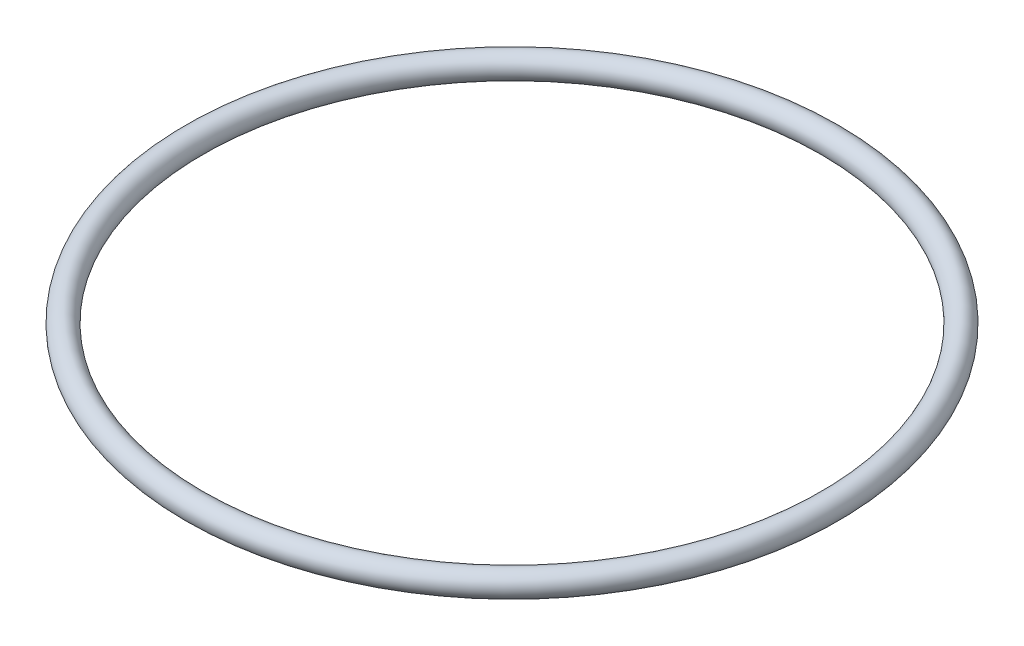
from build123d import *

# Parameters (mm, degrees)
SKETCH2_R = 1.3081


with BuildPart() as part:
    # Sweep1: sweep along a path in Sketch1
    with BuildLine(Plane(origin=(0, 0, 0), x_dir=(1, 0, 0), z_dir=(0, 1, 0))) as sweep1_path:
        CenterArc((0, 0), 33.1724, 0, 360)
    # Sketch2 → Sweep1 (sweep)
    with BuildSketch(Plane.XY):
        with Locations((-34.4805, 0)):
            Circle(SKETCH2_R)
    sweep(path=sweep1_path.line)


solid = part.part
